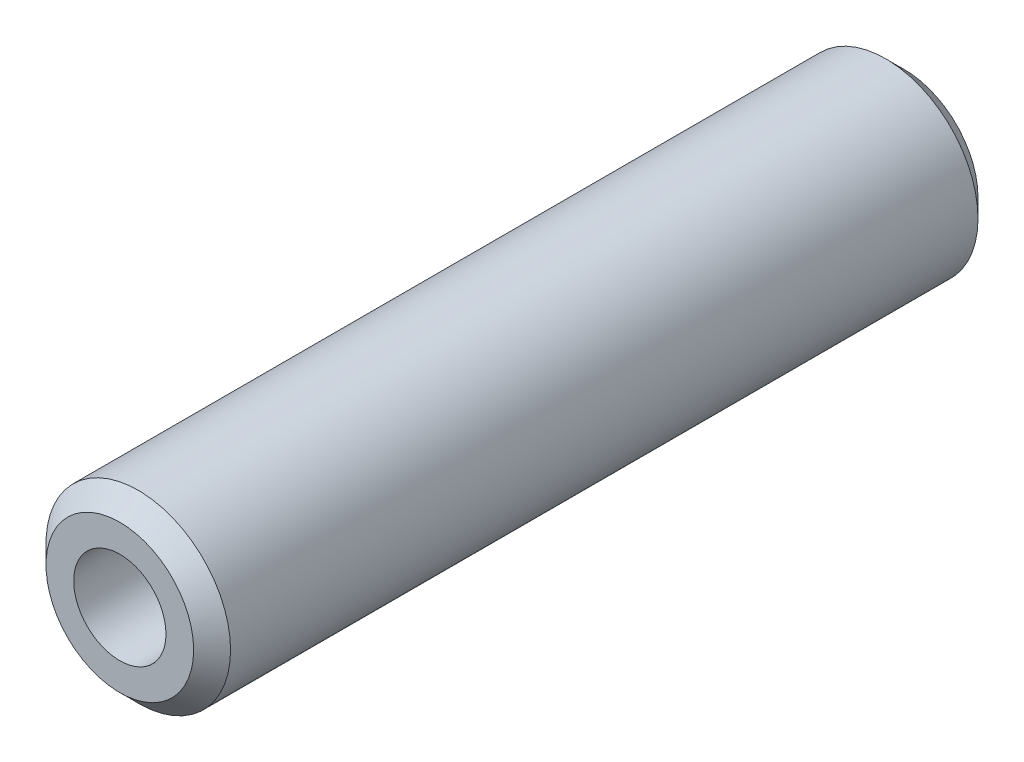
from build123d import *

# Parameters (mm, degrees)
ESQUISSE1_R          = 2
ESQUISSE1_R_2        = 1
BASE_EXTRUSION_DEPTH = 8.5
CHANFREIN2_SIZE      = 0.4


with BuildPart() as part:
    # Esquisse1 → Base-Extrusion (new, symmetric)
    with BuildSketch(Plane.XY):
        Circle(ESQUISSE1_R)
        Circle(ESQUISSE1_R_2, mode=Mode.SUBTRACT)
    extrude(amount=BASE_EXTRUSION_DEPTH, both=True)

    # Chanfrein2
    chanfrein2_edges = [part.edges().sort_by_distance(p)[0] for p in [
        (-2, 0, -8.5),
        (-2, 0, 8.5),
    ]]
    chamfer(chanfrein2_edges, length=CHANFREIN2_SIZE)


solid = part.part
